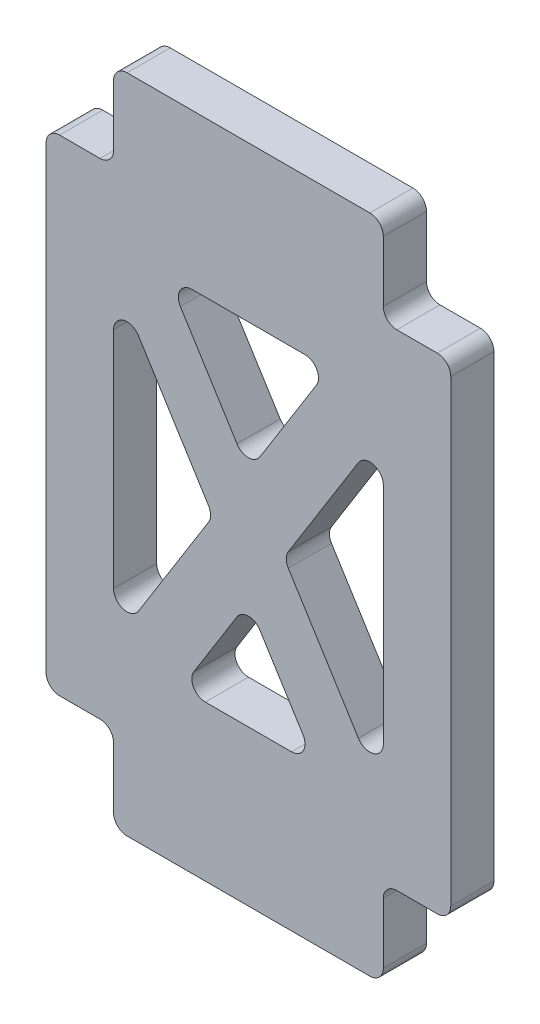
from build123d import *

# Parameters (mm, degrees)
SKETCH1_W           = 30
SKETCH1_H           = 36
BOSS_EXTRUDE1_DEPTH = 3.2
SKETCH2_W           = 20
SKETCH2_H           = 3.2
BOSS_EXTRUDE2_DEPTH = 6.5
SKETCH3_W           = 20
SKETCH3_H           = 3.2
BOSS_EXTRUDE3_DEPTH = 6.5
FILLET1_R           = 1
CUT_EXTRUDE1_DEPTH  = 10
FILLET2_R           = 1


with BuildPart() as part:
    # Sketch1 → Boss-Extrude1 (new body)
    with BuildSketch(Plane.XY):
        Rectangle(SKETCH1_W, SKETCH1_H)
    extrude(amount=BOSS_EXTRUDE1_DEPTH)

    # Sketch2 → Boss-Extrude2 (add)
    with BuildSketch(Plane(origin=(0, 18, 0), x_dir=(1, 0, 0), z_dir=(0, 1, 0))):
        with Locations((0, -1.6)):
            Rectangle(SKETCH2_W, SKETCH2_H)
    extrude(amount=BOSS_EXTRUDE2_DEPTH)

    # Sketch3 → Boss-Extrude3 (add)
    with BuildSketch(Plane.XZ.offset(18)):
        with Locations((0, 1.6)):
            Rectangle(SKETCH3_W, SKETCH3_H)
    extrude(amount=BOSS_EXTRUDE3_DEPTH)

    # Fillet1
    fillet1_edges = [part.edges().sort_by_distance(p)[0] for p in [
        (-15, -18, 1.6),
        (-10, -18, 1.6),
        (-10, -24.5, 1.6),
        (10, -24.5, 1.6),
        (10, -18, 1.6),
        (15, -18, 1.6),
        (15, 18, 1.6),
        (-15, 18, 1.6),
        (-10, 18, 1.6),
        (-10, 24.5, 1.6),
        (10, 24.5, 1.6),
        (10, 18, 1.6),
    ]]
    fillet(fillet1_edges, radius=FILLET1_R)

    # Sketch4 → Cut-Extrude1 (cut)
    with BuildSketch(Plane(origin=(0, 0, 0), x_dir=(-1, 0, 0), z_dir=(0, 0, -1))):
        Polygon((6, 13), (0, 3.4), (-6, 13), align=None)
        Polygon((10, 11), (2.625, -0.8), (10, -12.6), align=None)
        Polygon((-10, 11), (-2.625, -0.8), (-10, -12.6), align=None)
        Polygon((0, -5), (-5, -13), (5, -13), align=None)
    extrude(amount=-CUT_EXTRUDE1_DEPTH, mode=Mode.SUBTRACT)

    # Fillet2
    fillet2_edges = [part.edges().sort_by_distance(p)[0] for p in [
        (2.625, -0.8, 1.6),
        (10, -12.6, 1.6),
        (10, 11, 1.6),
        (-10, 11, 1.6),
        (-10, -12.6, 1.6),
        (-2.625, -0.8, 1.6),
        (0, 3.4, 1.6),
        (6, 13, 1.6),
        (-6, 13, 1.6),
        (0, -5, 1.6),
        (-5, -13, 1.6),
        (5, -13, 1.6),
    ]]
    fillet(fillet2_edges, radius=FILLET2_R)


solid = part.part
